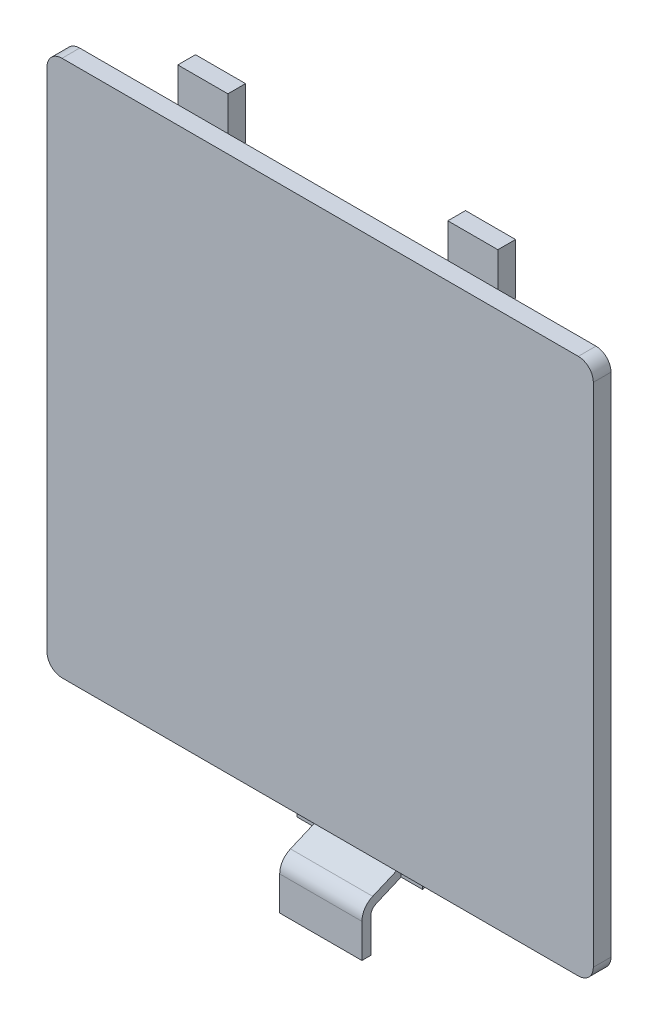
from build123d import *

# Parameters (mm, degrees)
EXTRUSION3_DEPTH        = 2
ESQUISSE2_W             = 5.663973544
ESQUISSE2_H             = 5.77995935
EXTRUSION4_DEPTH        = 2
EXTRU_MINCE1_DEPTH      = 7.1
EXTRU_MINCE1_DEPTH_BACK = 7.1
ENL_V_MAT_EXTRU_1_REACH = 84.223
ESQUISSE5_W             = 2.45
ESQUISSE5_H             = 4.426836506


with BuildPart() as part:
    # Esquisse1 → Extrusion3 (new body)
    with BuildSketch(Plane.XY):
        with BuildLine():
            Line((-29.2, -38.348281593), (7.85, -38.348281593))
            Line((7.85, -38.348281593), (29.2, -38.348281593))
            ThreePointArc((29.2, -38.348281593), (30.402081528, -37.850363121), (30.9, -36.648281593))
            Line((30.9, -36.648281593), (30.9, 20.651718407))
            ThreePointArc((30.9, 20.651718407), (30.402081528, 21.853799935), (29.2, 22.351718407))
            Line((29.2, 22.351718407), (-29.2, 22.351718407))
            ThreePointArc((-29.2, 22.351718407), (-30.402081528, 21.853799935), (-30.9, 20.651718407))
            Line((-30.9, 20.651718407), (-30.9, -36.648281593))
            ThreePointArc((-30.9, -36.648281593), (-30.402081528, -37.850363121), (-29.2, -38.348281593))
        make_face()
    extrude(amount=-EXTRUSION3_DEPTH)

    # Esquisse2 → Extrusion4 (add)
    with BuildSketch(Plane(origin=(0, 0, -2), x_dir=(-1, 0, 0), z_dir=(0, 0, -1))):
        with Locations((-15.271206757, 23.359511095)):
            Rectangle(ESQUISSE2_W, ESQUISSE2_H)
        with Locations((15.271206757, 23.359511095)):
            Rectangle(ESQUISSE2_W, ESQUISSE2_H)
    extrude(amount=EXTRUSION4_DEPTH)

    # Esquisse3 → Extru.-Mince1 (add, two sides: drawn at the far end of the back side and taken through both)
    with BuildSketch(Plane(origin=(0, 0, 0), x_dir=(0, 0, -1), z_dir=(1, 0, 0)).offset(-EXTRU_MINCE1_DEPTH_BACK)):
        with BuildLine():
            Line((2, -37.498281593), (9.240661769, -37.498281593))
            ThreePointArc((9.240661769, -37.498281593), (10.964470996, -38.905834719), (9.93002371, -40.876277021))
            Line((9.93002371, -40.876277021), (1.681333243, -44.389271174))
            ThreePointArc((1.681333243, -44.389271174), (1.238948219, -44.75786979), (1.073163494, -45.309308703))
            Line((1.073163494, -45.309308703), (1.073163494, -49.148281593))
            Line((1.073163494, -49.148281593), (0.073163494, -49.148281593))
            Line((0.073163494, -49.148281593), (0.073163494, -45.309308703))
            ThreePointArc((0.073163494, -45.309308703), (0.404732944, -44.206430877), (1.289502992, -43.469233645))
            Line((1.289502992, -43.469233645), (9.538193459, -39.956239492))
            ThreePointArc((9.538193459, -39.956239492), (9.984665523, -39.105787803), (9.240661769, -38.498281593))
            Line((9.240661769, -38.498281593), (2, -38.498281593))
            Line((2, -38.498281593), (2, -37.498281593))
        make_face()
    extrude(amount=EXTRU_MINCE1_DEPTH + EXTRU_MINCE1_DEPTH_BACK)

    # Esquisse5 → Enl_v. mat.-Extru.1 (cut, up to next)
    with BuildSketch(Plane.XZ.offset(49.148281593), mode=Mode.PRIVATE) as enl_v_mat_extru_1_sk1:
        with Locations((5.875, -2.286581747)):
            Rectangle(ESQUISSE5_W, ESQUISSE5_H)
    enl_v_mat_extru_1_tool1 = extrude(enl_v_mat_extru_1_sk1.sketch, amount=-ENL_V_MAT_EXTRU_1_REACH, mode=Mode.PRIVATE) & part.part
    # Esquisse5 → Enl_v. mat.-Extru.1 (cut, up to next)
    with BuildSketch(Plane.XZ.offset(49.148281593), mode=Mode.PRIVATE) as enl_v_mat_extru_1_sk2:
        with Locations((-5.875, -2.286581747)):
            Rectangle(ESQUISSE5_W, ESQUISSE5_H)
    enl_v_mat_extru_1_tool2 = extrude(enl_v_mat_extru_1_sk2.sketch, amount=-ENL_V_MAT_EXTRU_1_REACH, mode=Mode.PRIVATE) & part.part
    add(enl_v_mat_extru_1_tool1.solids().sort_by_distance((5.875, -49.148282, -2.286582))[0], mode=Mode.SUBTRACT)
    add(enl_v_mat_extru_1_tool2.solids().sort_by_distance((-5.875, -49.148282, -2.286582))[0], mode=Mode.SUBTRACT)


solid = part.part
